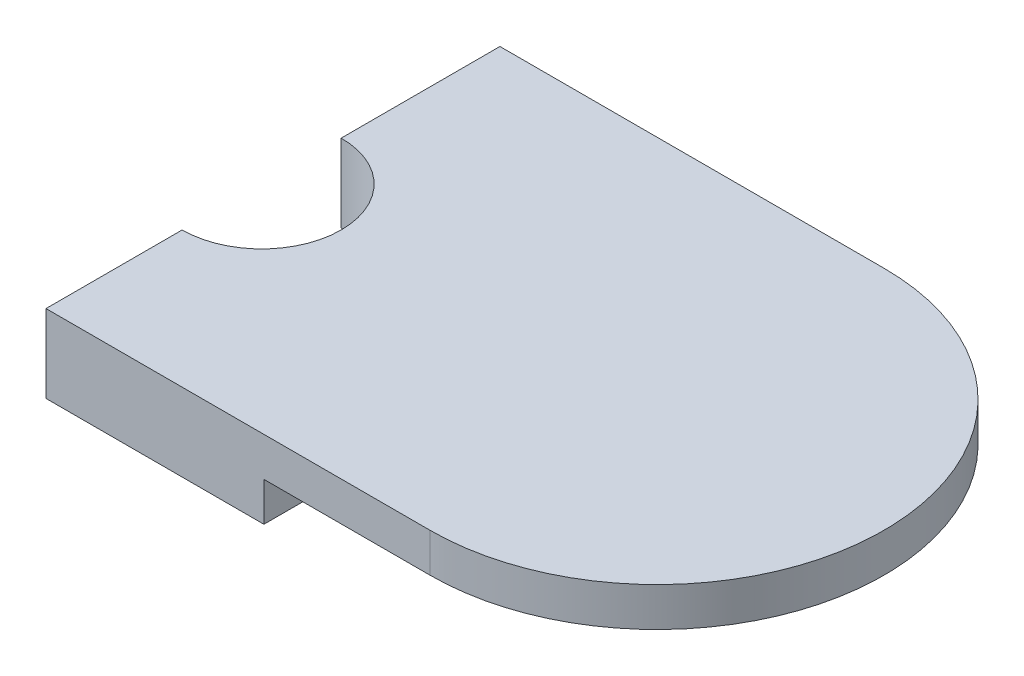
ISO-10303-21;
HEADER;
FILE_DESCRIPTION(('STEP AP214'),'2;1');
FILE_NAME('part.step','',(''),(''),'','','');
FILE_SCHEMA(('AUTOMOTIVE_DESIGN { 1 0 10303 214 1 1 1 1 }'));
ENDSEC;
DATA;
#1=APPLICATION_CONTEXT('core data for automotive mechanical design processes');
#2=APPLICATION_PROTOCOL_DEFINITION('international standard','automotive_design',2000,#1);
#3=PRODUCT_CONTEXT('',#1,'mechanical');
#4=PRODUCT('Part','Part','',(#3));
#5=PRODUCT_RELATED_PRODUCT_CATEGORY('part','',(#4));
#6=PRODUCT_DEFINITION_FORMATION('','',#4);
#7=PRODUCT_DEFINITION_CONTEXT('part definition',#1,'design');
#8=PRODUCT_DEFINITION('design','',#6,#7);
#9=PRODUCT_DEFINITION_SHAPE('','',#8);
#10=(LENGTH_UNIT() NAMED_UNIT(*) SI_UNIT(.MILLI.,.METRE.));
#11=(NAMED_UNIT(*) PLANE_ANGLE_UNIT() SI_UNIT($,.RADIAN.));
#12=(NAMED_UNIT(*) SI_UNIT($,.STERADIAN.) SOLID_ANGLE_UNIT());
#13=UNCERTAINTY_MEASURE_WITH_UNIT(LENGTH_MEASURE(1.E-05),#10,'distance_accuracy_value','');
#14=(GEOMETRIC_REPRESENTATION_CONTEXT(3) GLOBAL_UNCERTAINTY_ASSIGNED_CONTEXT((#13)) GLOBAL_UNIT_ASSIGNED_CONTEXT((#10,
#11,#12)) REPRESENTATION_CONTEXT('',''));
#15=CARTESIAN_POINT('',(0.,0.,0.));
#16=DIRECTION('',(0.,0.,1.));
#17=DIRECTION('',(1.,0.,0.));
#18=AXIS2_PLACEMENT_3D('',#15,#16,#17);
#19=CARTESIAN_POINT('',(0.,12.7,0.));
#20=DIRECTION('',(0.,0.,-1.));
#21=DIRECTION('',(-1.,0.,0.));
#22=AXIS2_PLACEMENT_3D('',#19,#20,#21);
#23=PLANE('',#22);
#24=DIRECTION('',(0.,-1.,0.));
#25=VECTOR('',#24,1.);
#26=CARTESIAN_POINT('',(0.,12.7,0.));
#27=LINE('',#26,#25);
#28=CARTESIAN_POINT('',(0.,12.7,0.));
#29=VERTEX_POINT('',#28);
#30=CARTESIAN_POINT('',(0.,0.,0.));
#31=VERTEX_POINT('',#30);
#32=EDGE_CURVE('E104',#29,#31,#27,.T.);
#33=ORIENTED_EDGE('',*,*,#32,.T.);
#34=DIRECTION('',(1.,0.,0.));
#35=VECTOR('',#34,1.);
#36=CARTESIAN_POINT('',(0.,0.,0.));
#37=LINE('',#36,#35);
#38=CARTESIAN_POINT('',(35.5347794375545,0.,0.));
#39=VERTEX_POINT('',#38);
#40=EDGE_CURVE('E94',#31,#39,#37,.T.);
#41=ORIENTED_EDGE('',*,*,#40,.T.);
#42=DIRECTION('',(0.,1.,0.));
#43=VECTOR('',#42,1.);
#44=CARTESIAN_POINT('',(35.5347794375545,12.7,0.));
#45=LINE('',#44,#43);
#46=CARTESIAN_POINT('',(35.5347794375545,6.35,0.));
#47=VERTEX_POINT('',#46);
#48=EDGE_CURVE('E102',#39,#47,#45,.T.);
#49=ORIENTED_EDGE('',*,*,#48,.T.);
#50=DIRECTION('',(1.,0.,0.));
#51=VECTOR('',#50,1.);
#52=CARTESIAN_POINT('',(0.,6.35,0.));
#53=LINE('',#52,#51);
#54=CARTESIAN_POINT('',(62.6371240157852,6.35,0.));
#55=VERTEX_POINT('',#54);
#56=EDGE_CURVE('E109',#47,#55,#53,.T.);
#57=ORIENTED_EDGE('',*,*,#56,.T.);
#58=DIRECTION('',(0.,-1.,0.));
#59=VECTOR('',#58,1.);
#60=CARTESIAN_POINT('',(62.6371240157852,12.7,0.));
#61=LINE('',#60,#59);
#62=CARTESIAN_POINT('',(62.6371240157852,12.7,0.));
#63=VERTEX_POINT('',#62);
#64=EDGE_CURVE('E139',#63,#55,#61,.T.);
#65=ORIENTED_EDGE('',*,*,#64,.F.);
#66=DIRECTION('',(1.,0.,0.));
#67=VECTOR('',#66,1.);
#68=CARTESIAN_POINT('',(0.,12.7,0.));
#69=LINE('',#68,#67);
#70=EDGE_CURVE('E112',#29,#63,#69,.T.);
#71=ORIENTED_EDGE('',*,*,#70,.F.);
#72=EDGE_LOOP('',(#33,#41,#49,#57,#65,#71));
#73=FACE_BOUND('',#72,.T.);
#74=ADVANCED_FACE('F30',(#73),#23,.F.);
#75=CARTESIAN_POINT('',(0.,12.7,-74.0208769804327));
#76=DIRECTION('',(0.,0.,1.));
#77=DIRECTION('',(1.,0.,0.));
#78=AXIS2_PLACEMENT_3D('',#75,#76,#77);
#79=PLANE('',#78);
#80=DIRECTION('',(0.,-1.,0.));
#81=VECTOR('',#80,1.);
#82=CARTESIAN_POINT('',(35.5347794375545,12.7,-74.0208769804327));
#83=LINE('',#82,#81);
#84=CARTESIAN_POINT('',(35.5347794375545,6.35,-74.0208769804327));
#85=VERTEX_POINT('',#84);
#86=CARTESIAN_POINT('',(35.5347794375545,0.,-74.0208769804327));
#87=VERTEX_POINT('',#86);
#88=EDGE_CURVE('E38',#85,#87,#83,.T.);
#89=ORIENTED_EDGE('',*,*,#88,.T.);
#90=DIRECTION('',(-1.,0.,0.));
#91=VECTOR('',#90,1.);
#92=CARTESIAN_POINT('',(0.,0.,-74.0208769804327));
#93=LINE('',#92,#91);
#94=CARTESIAN_POINT('',(0.,0.,-74.0208769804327));
#95=VERTEX_POINT('',#94);
#96=EDGE_CURVE('E45',#87,#95,#93,.T.);
#97=ORIENTED_EDGE('',*,*,#96,.T.);
#98=DIRECTION('',(0.,-1.,0.));
#99=VECTOR('',#98,1.);
#100=CARTESIAN_POINT('',(0.,12.7,-74.0208769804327));
#101=LINE('',#100,#99);
#102=CARTESIAN_POINT('',(0.,12.7,-74.0208769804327));
#103=VERTEX_POINT('',#102);
#104=EDGE_CURVE('E133',#103,#95,#101,.T.);
#105=ORIENTED_EDGE('',*,*,#104,.F.);
#106=DIRECTION('',(-1.,0.,0.));
#107=VECTOR('',#106,1.);
#108=CARTESIAN_POINT('',(0.,12.7,-74.0208769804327));
#109=LINE('',#108,#107);
#110=CARTESIAN_POINT('',(62.6371240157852,12.7,-74.0208769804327));
#111=VERTEX_POINT('',#110);
#112=EDGE_CURVE('E121',#111,#103,#109,.T.);
#113=ORIENTED_EDGE('',*,*,#112,.F.);
#114=DIRECTION('',(0.,-1.,0.));
#115=VECTOR('',#114,1.);
#116=CARTESIAN_POINT('',(62.6371240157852,12.7,-74.0208769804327));
#117=LINE('',#116,#115);
#118=CARTESIAN_POINT('',(62.6371240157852,6.35,-74.0208769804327));
#119=VERTEX_POINT('',#118);
#120=EDGE_CURVE('E136',#111,#119,#117,.T.);
#121=ORIENTED_EDGE('',*,*,#120,.T.);
#122=DIRECTION('',(-1.,0.,0.));
#123=VECTOR('',#122,1.);
#124=CARTESIAN_POINT('',(0.,6.35,-74.0208769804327));
#125=LINE('',#124,#123);
#126=EDGE_CURVE('E143',#119,#85,#125,.T.);
#127=ORIENTED_EDGE('',*,*,#126,.T.);
#128=EDGE_LOOP('',(#89,#97,#105,#113,#121,#127));
#129=FACE_BOUND('',#128,.T.);
#130=ADVANCED_FACE('F146',(#129),#79,.F.);
#131=CARTESIAN_POINT('',(0.,12.7,0.));
#132=DIRECTION('',(1.,0.,0.));
#133=DIRECTION('',(0.,0.,-1.));
#134=AXIS2_PLACEMENT_3D('',#131,#132,#133);
#135=PLANE('',#134);
#136=DIRECTION('',(0.,-1.,0.));
#137=VECTOR('',#136,1.);
#138=CARTESIAN_POINT('',(0.,12.7,-22.1991821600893));
#139=LINE('',#138,#137);
#140=CARTESIAN_POINT('',(0.,12.7,-22.1991821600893));
#141=VERTEX_POINT('',#140);
#142=CARTESIAN_POINT('',(0.,0.,-22.1991821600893));
#143=VERTEX_POINT('',#142);
#144=EDGE_CURVE('E127',#141,#143,#139,.T.);
#145=ORIENTED_EDGE('',*,*,#144,.T.);
#146=DIRECTION('',(0.,0.,1.));
#147=VECTOR('',#146,1.);
#148=CARTESIAN_POINT('',(0.,0.,0.));
#149=LINE('',#148,#147);
#150=EDGE_CURVE('E161',#143,#31,#149,.T.);
#151=ORIENTED_EDGE('',*,*,#150,.T.);
#152=ORIENTED_EDGE('',*,*,#32,.F.);
#153=DIRECTION('',(0.,0.,1.));
#154=VECTOR('',#153,1.);
#155=CARTESIAN_POINT('',(0.,12.7,0.));
#156=LINE('',#155,#154);
#157=EDGE_CURVE('E108',#141,#29,#156,.T.);
#158=ORIENTED_EDGE('',*,*,#157,.F.);
#159=EDGE_LOOP('',(#145,#151,#152,#158));
#160=FACE_BOUND('',#159,.T.);
#161=ADVANCED_FACE('F32',(#160),#135,.F.);
#162=CARTESIAN_POINT('',(62.6371240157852,12.7,-37.0104384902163));
#163=DIRECTION('',(0.,-1.,0.));
#164=DIRECTION('',(0.,0.,-1.));
#165=AXIS2_PLACEMENT_3D('',#162,#163,#164);
#166=CYLINDRICAL_SURFACE('',#165,37.0104384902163);
#167=ORIENTED_EDGE('',*,*,#64,.T.);
#168=CARTESIAN_POINT('',(62.6371240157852,6.35,-37.0104384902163));
#169=DIRECTION('',(0.,1.,0.));
#170=DIRECTION('',(0.,0.,1.));
#171=AXIS2_PLACEMENT_3D('',#168,#169,#170);
#172=CIRCLE('',#171,37.0104384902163);
#173=EDGE_CURVE('E114',#55,#119,#172,.T.);
#174=ORIENTED_EDGE('',*,*,#173,.T.);
#175=ORIENTED_EDGE('',*,*,#120,.F.);
#176=CARTESIAN_POINT('',(62.6371240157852,12.7,-37.0104384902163));
#177=DIRECTION('',(0.,1.,0.));
#178=DIRECTION('',(0.,0.,-1.));
#179=AXIS2_PLACEMENT_3D('',#176,#177,#178);
#180=CIRCLE('',#179,37.0104384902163);
#181=EDGE_CURVE('E119',#63,#111,#180,.T.);
#182=ORIENTED_EDGE('',*,*,#181,.F.);
#183=EDGE_LOOP('',(#167,#174,#175,#182));
#184=FACE_BOUND('',#183,.T.);
#185=ADVANCED_FACE('F153',(#184),#166,.T.);
#186=CARTESIAN_POINT('',(0.,12.7,-48.1378847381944));
#187=DIRECTION('',(1.,0.,0.));
#188=DIRECTION('',(0.,0.,-1.));
#189=AXIS2_PLACEMENT_3D('',#186,#187,#188);
#190=PLANE('',#189);
#191=ORIENTED_EDGE('',*,*,#104,.T.);
#192=DIRECTION('',(0.,0.,1.));
#193=VECTOR('',#192,1.);
#194=CARTESIAN_POINT('',(0.,0.,-48.1378847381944));
#195=LINE('',#194,#193);
#196=CARTESIAN_POINT('',(0.,0.,-48.1378847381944));
#197=VERTEX_POINT('',#196);
#198=EDGE_CURVE('E105',#95,#197,#195,.T.);
#199=ORIENTED_EDGE('',*,*,#198,.T.);
#200=DIRECTION('',(0.,-1.,0.));
#201=VECTOR('',#200,1.);
#202=CARTESIAN_POINT('',(0.,12.7,-48.1378847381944));
#203=LINE('',#202,#201);
#204=CARTESIAN_POINT('',(0.,12.7,-48.1378847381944));
#205=VERTEX_POINT('',#204);
#206=EDGE_CURVE('E130',#205,#197,#203,.T.);
#207=ORIENTED_EDGE('',*,*,#206,.F.);
#208=DIRECTION('',(0.,0.,1.));
#209=VECTOR('',#208,1.);
#210=CARTESIAN_POINT('',(0.,12.7,-48.1378847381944));
#211=LINE('',#210,#209);
#212=EDGE_CURVE('E123',#103,#205,#211,.T.);
#213=ORIENTED_EDGE('',*,*,#212,.F.);
#214=EDGE_LOOP('',(#191,#199,#207,#213));
#215=FACE_BOUND('',#214,.T.);
#216=ADVANCED_FACE('F167',(#215),#190,.F.);
#217=CARTESIAN_POINT('',(0.,12.7,-35.1685334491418));
#218=DIRECTION('',(0.,-1.,0.));
#219=DIRECTION('',(0.,0.,-1.));
#220=AXIS2_PLACEMENT_3D('',#217,#218,#219);
#221=CYLINDRICAL_SURFACE('',#220,12.9693512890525);
#222=ORIENTED_EDGE('',*,*,#206,.T.);
#223=CARTESIAN_POINT('',(0.,0.,-35.1685334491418));
#224=DIRECTION('',(0.,1.,0.));
#225=DIRECTION('',(0.,0.,1.));
#226=AXIS2_PLACEMENT_3D('',#223,#224,#225);
#227=CIRCLE('',#226,12.9693512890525);
#228=EDGE_CURVE('E156',#197,#143,#227,.F.);
#229=ORIENTED_EDGE('',*,*,#228,.T.);
#230=ORIENTED_EDGE('',*,*,#144,.F.);
#231=CARTESIAN_POINT('',(0.,12.7,-35.1685334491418));
#232=DIRECTION('',(0.,-1.,0.));
#233=DIRECTION('',(0.,0.,-1.));
#234=AXIS2_PLACEMENT_3D('',#231,#232,#233);
#235=CIRCLE('',#234,12.9693512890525);
#236=EDGE_CURVE('E125',#205,#141,#235,.T.);
#237=ORIENTED_EDGE('',*,*,#236,.F.);
#238=EDGE_LOOP('',(#222,#229,#230,#237));
#239=FACE_BOUND('',#238,.T.);
#240=ADVANCED_FACE('F171',(#239),#221,.F.);
#241=CARTESIAN_POINT('',(0.,12.7,-35.1685334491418));
#242=DIRECTION('',(0.,-1.,0.));
#243=DIRECTION('',(0.,0.,-1.));
#244=AXIS2_PLACEMENT_3D('',#241,#242,#243);
#245=PLANE('',#244);
#246=ORIENTED_EDGE('',*,*,#157,.T.);
#247=ORIENTED_EDGE('',*,*,#70,.T.);
#248=ORIENTED_EDGE('',*,*,#181,.T.);
#249=ORIENTED_EDGE('',*,*,#112,.T.);
#250=ORIENTED_EDGE('',*,*,#212,.T.);
#251=ORIENTED_EDGE('',*,*,#236,.T.);
#252=EDGE_LOOP('',(#246,#247,#248,#249,#250,#251));
#253=FACE_BOUND('',#252,.T.);
#254=ADVANCED_FACE('F175',(#253),#245,.F.);
#255=CARTESIAN_POINT('',(35.5347794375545,-6.35,-85.4025246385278));
#256=DIRECTION('',(-1.,0.,0.));
#257=DIRECTION('',(0.,0.,1.));
#258=AXIS2_PLACEMENT_3D('',#255,#256,#257);
#259=PLANE('',#258);
#260=ORIENTED_EDGE('',*,*,#48,.F.);
#261=DIRECTION('',(0.,0.,-1.));
#262=VECTOR('',#261,1.);
#263=CARTESIAN_POINT('',(35.5347794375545,0.,-85.4025246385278));
#264=LINE('',#263,#262);
#265=EDGE_CURVE('E11',#39,#87,#264,.T.);
#266=ORIENTED_EDGE('',*,*,#265,.T.);
#267=ORIENTED_EDGE('',*,*,#88,.F.);
#268=DIRECTION('',(0.,0.,1.));
#269=VECTOR('',#268,1.);
#270=CARTESIAN_POINT('',(35.5347794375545,6.35,-85.4025246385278));
#271=LINE('',#270,#269);
#272=EDGE_CURVE('E52',#85,#47,#271,.T.);
#273=ORIENTED_EDGE('',*,*,#272,.T.);
#274=EDGE_LOOP('',(#260,#266,#267,#273));
#275=FACE_BOUND('',#274,.T.);
#276=ADVANCED_FACE('F107',(#275),#259,.F.);
#277=CARTESIAN_POINT('',(35.5347794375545,6.35,17.0972483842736));
#278=DIRECTION('',(0.,1.,0.));
#279=DIRECTION('',(0.,0.,1.));
#280=AXIS2_PLACEMENT_3D('',#277,#278,#279);
#281=PLANE('',#280);
#282=ORIENTED_EDGE('',*,*,#272,.F.);
#283=ORIENTED_EDGE('',*,*,#126,.F.);
#284=ORIENTED_EDGE('',*,*,#173,.F.);
#285=ORIENTED_EDGE('',*,*,#56,.F.);
#286=EDGE_LOOP('',(#282,#283,#284,#285));
#287=FACE_BOUND('',#286,.T.);
#288=ADVANCED_FACE('F151',(#287),#281,.F.);
#289=CARTESIAN_POINT('',(-12.0952266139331,0.,14.8110080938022));
#290=DIRECTION('',(0.,1.,0.));
#291=DIRECTION('',(0.,0.,1.));
#292=AXIS2_PLACEMENT_3D('',#289,#290,#291);
#293=PLANE('',#292);
#294=ORIENTED_EDGE('',*,*,#198,.F.);
#295=ORIENTED_EDGE('',*,*,#96,.F.);
#296=ORIENTED_EDGE('',*,*,#265,.F.);
#297=ORIENTED_EDGE('',*,*,#40,.F.);
#298=ORIENTED_EDGE('',*,*,#150,.F.);
#299=ORIENTED_EDGE('',*,*,#228,.F.);
#300=EDGE_LOOP('',(#294,#295,#296,#297,#298,#299));
#301=FACE_BOUND('',#300,.T.);
#302=ADVANCED_FACE('F93',(#301),#293,.F.);
#303=CLOSED_SHELL('',(#74,#130,#161,#185,#216,#240,#254,#276,#288,#302));
#304=MANIFOLD_SOLID_BREP('B2',#303);
#305=ADVANCED_BREP_SHAPE_REPRESENTATION('',(#18,#304),#14);
#306=SHAPE_DEFINITION_REPRESENTATION(#9,#305);
ENDSEC;
END-ISO-10303-21;
